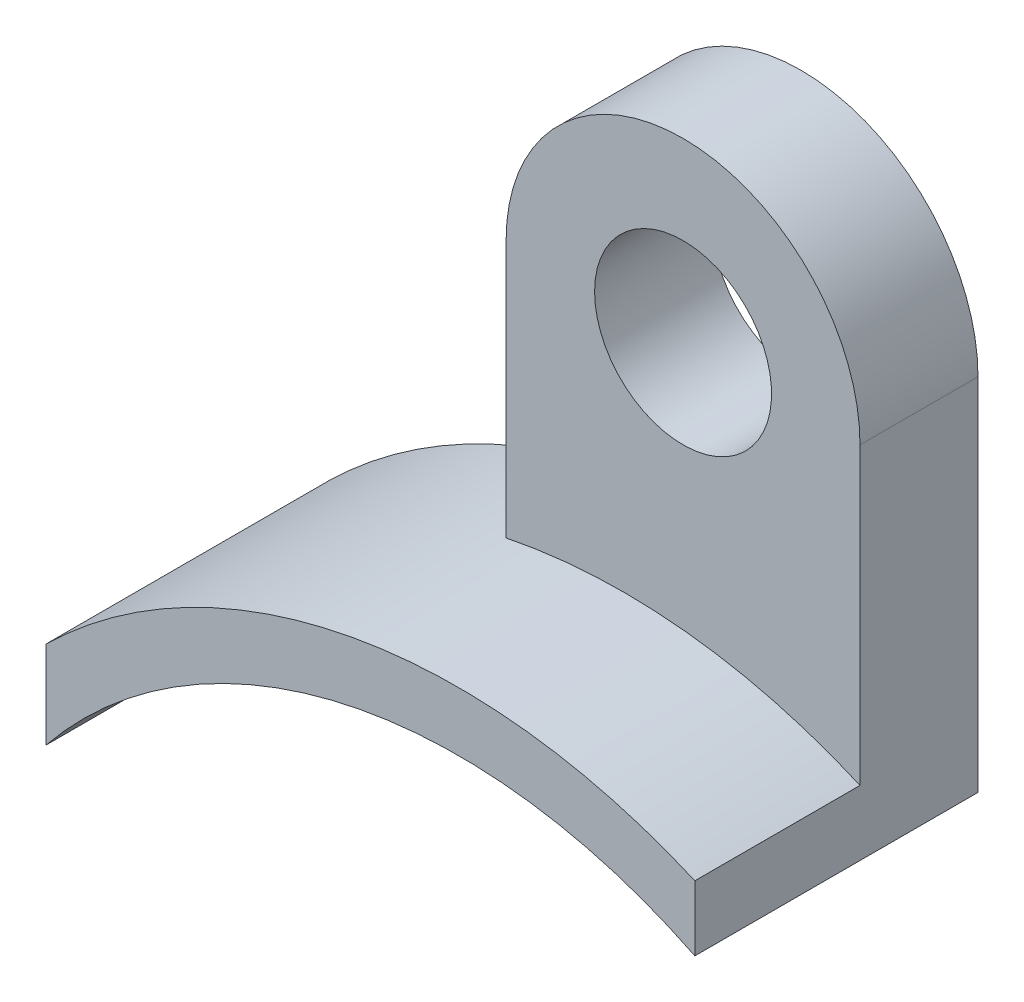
ISO-10303-21;
HEADER;
FILE_DESCRIPTION(('STEP AP214'),'2;1');
FILE_NAME('part.step','',(''),(''),'','','');
FILE_SCHEMA(('AUTOMOTIVE_DESIGN { 1 0 10303 214 1 1 1 1 }'));
ENDSEC;
DATA;
#1=APPLICATION_CONTEXT('core data for automotive mechanical design processes');
#2=APPLICATION_PROTOCOL_DEFINITION('international standard','automotive_design',2000,#1);
#3=PRODUCT_CONTEXT('',#1,'mechanical');
#4=PRODUCT('Part','Part','',(#3));
#5=PRODUCT_RELATED_PRODUCT_CATEGORY('part','',(#4));
#6=PRODUCT_DEFINITION_FORMATION('','',#4);
#7=PRODUCT_DEFINITION_CONTEXT('part definition',#1,'design');
#8=PRODUCT_DEFINITION('design','',#6,#7);
#9=PRODUCT_DEFINITION_SHAPE('','',#8);
#10=(LENGTH_UNIT() NAMED_UNIT(*) SI_UNIT(.MILLI.,.METRE.));
#11=(NAMED_UNIT(*) PLANE_ANGLE_UNIT() SI_UNIT($,.RADIAN.));
#12=(NAMED_UNIT(*) SI_UNIT($,.STERADIAN.) SOLID_ANGLE_UNIT());
#13=UNCERTAINTY_MEASURE_WITH_UNIT(LENGTH_MEASURE(1.E-05),#10,'distance_accuracy_value','');
#14=(GEOMETRIC_REPRESENTATION_CONTEXT(3) GLOBAL_UNCERTAINTY_ASSIGNED_CONTEXT((#13)) GLOBAL_UNIT_ASSIGNED_CONTEXT((#10,
#11,#12)) REPRESENTATION_CONTEXT('',''));
#15=CARTESIAN_POINT('',(0.,0.,0.));
#16=DIRECTION('',(0.,0.,1.));
#17=DIRECTION('',(1.,0.,0.));
#18=AXIS2_PLACEMENT_3D('',#15,#16,#17);
#19=CARTESIAN_POINT('',(0.,0.,24.));
#20=DIRECTION('',(0.,0.,-1.));
#21=DIRECTION('',(-1.,0.,0.));
#22=AXIS2_PLACEMENT_3D('',#19,#20,#21);
#23=CYLINDRICAL_SURFACE('',#22,45.);
#24=CARTESIAN_POINT('',(0.,0.,0.));
#25=DIRECTION('',(0.,0.,-1.));
#26=DIRECTION('',(1.,0.,0.));
#27=AXIS2_PLACEMENT_3D('',#24,#25,#26);
#28=CIRCLE('',#27,45.);
#29=CARTESIAN_POINT('',(-35.,28.2842712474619,0.));
#30=VERTEX_POINT('',#29);
#31=CARTESIAN_POINT('',(20.,40.3112887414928,0.));
#32=VERTEX_POINT('',#31);
#33=EDGE_CURVE('E120',#30,#32,#28,.T.);
#34=ORIENTED_EDGE('',*,*,#33,.T.);
#35=DIRECTION('',(0.,0.,-1.));
#36=VECTOR('',#35,1.);
#37=CARTESIAN_POINT('',(20.,40.3112887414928,24.));
#38=LINE('',#37,#36);
#39=CARTESIAN_POINT('',(20.,40.3112887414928,24.));
#40=VERTEX_POINT('',#39);
#41=EDGE_CURVE('E11',#40,#32,#38,.T.);
#42=ORIENTED_EDGE('',*,*,#41,.F.);
#43=CARTESIAN_POINT('',(0.,0.,24.));
#44=DIRECTION('',(0.,0.,-1.));
#45=DIRECTION('',(1.,0.,0.));
#46=AXIS2_PLACEMENT_3D('',#43,#44,#45);
#47=CIRCLE('',#46,45.);
#48=CARTESIAN_POINT('',(-35.,28.2842712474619,24.));
#49=VERTEX_POINT('',#48);
#50=EDGE_CURVE('E123',#49,#40,#47,.T.);
#51=ORIENTED_EDGE('',*,*,#50,.F.);
#52=DIRECTION('',(0.,0.,-1.));
#53=VECTOR('',#52,1.);
#54=CARTESIAN_POINT('',(-35.,28.2842712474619,24.));
#55=LINE('',#54,#53);
#56=EDGE_CURVE('E133',#49,#30,#55,.T.);
#57=ORIENTED_EDGE('',*,*,#56,.T.);
#58=EDGE_LOOP('',(#34,#42,#51,#57));
#59=FACE_BOUND('',#58,.T.);
#60=ADVANCED_FACE('F31',(#59),#23,.F.);
#61=CARTESIAN_POINT('',(20.,45.8257569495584,24.));
#62=DIRECTION('',(-1.,0.,0.));
#63=DIRECTION('',(0.,-1.,0.));
#64=AXIS2_PLACEMENT_3D('',#61,#62,#63);
#65=PLANE('',#64);
#66=DIRECTION('',(0.,1.,0.));
#67=VECTOR('',#66,1.);
#68=CARTESIAN_POINT('',(20.,45.8257569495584,0.));
#69=LINE('',#68,#67);
#70=CARTESIAN_POINT('',(20.,70.8257569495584,0.));
#71=VERTEX_POINT('',#70);
#72=EDGE_CURVE('E136',#32,#71,#69,.T.);
#73=ORIENTED_EDGE('',*,*,#72,.T.);
#74=DIRECTION('',(0.,0.,-1.));
#75=VECTOR('',#74,1.);
#76=CARTESIAN_POINT('',(20.,70.8257569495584,10.));
#77=LINE('',#76,#75);
#78=CARTESIAN_POINT('',(20.,70.8257569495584,10.));
#79=VERTEX_POINT('',#78);
#80=EDGE_CURVE('E100',#79,#71,#77,.T.);
#81=ORIENTED_EDGE('',*,*,#80,.F.);
#82=DIRECTION('',(0.,-1.,0.));
#83=VECTOR('',#82,1.);
#84=CARTESIAN_POINT('',(20.,45.8257569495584,10.));
#85=LINE('',#84,#83);
#86=CARTESIAN_POINT('',(20.,45.8257569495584,10.));
#87=VERTEX_POINT('',#86);
#88=EDGE_CURVE('E108',#79,#87,#85,.T.);
#89=ORIENTED_EDGE('',*,*,#88,.T.);
#90=DIRECTION('',(0.,0.,-1.));
#91=VECTOR('',#90,1.);
#92=CARTESIAN_POINT('',(20.,45.8257569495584,24.));
#93=LINE('',#92,#91);
#94=CARTESIAN_POINT('',(20.,45.8257569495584,24.));
#95=VERTEX_POINT('',#94);
#96=EDGE_CURVE('E38',#95,#87,#93,.T.);
#97=ORIENTED_EDGE('',*,*,#96,.F.);
#98=DIRECTION('',(0.,1.,0.));
#99=VECTOR('',#98,1.);
#100=CARTESIAN_POINT('',(20.,45.8257569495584,24.));
#101=LINE('',#100,#99);
#102=EDGE_CURVE('E126',#40,#95,#101,.T.);
#103=ORIENTED_EDGE('',*,*,#102,.F.);
#104=ORIENTED_EDGE('',*,*,#41,.T.);
#105=EDGE_LOOP('',(#73,#81,#89,#97,#103,#104));
#106=FACE_BOUND('',#105,.T.);
#107=ADVANCED_FACE('F162',(#106),#65,.F.);
#108=CARTESIAN_POINT('',(0.,0.,24.));
#109=DIRECTION('',(0.,0.,-1.));
#110=DIRECTION('',(-1.,0.,0.));
#111=AXIS2_PLACEMENT_3D('',#108,#109,#110);
#112=CYLINDRICAL_SURFACE('',#111,50.);
#113=CARTESIAN_POINT('',(0.,0.,10.));
#114=DIRECTION('',(0.,0.,1.));
#115=DIRECTION('',(-1.,0.,0.));
#116=AXIS2_PLACEMENT_3D('',#113,#114,#115);
#117=CIRCLE('',#116,50.);
#118=CARTESIAN_POINT('',(-10.,48.9897948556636,10.));
#119=VERTEX_POINT('',#118);
#120=EDGE_CURVE('E45',#87,#119,#117,.T.);
#121=ORIENTED_EDGE('',*,*,#120,.T.);
#122=DIRECTION('',(0.,0.,-1.));
#123=VECTOR('',#122,1.);
#124=CARTESIAN_POINT('',(-10.,48.9897948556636,10.));
#125=LINE('',#124,#123);
#126=CARTESIAN_POINT('',(-10.,48.9897948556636,0.));
#127=VERTEX_POINT('',#126);
#128=EDGE_CURVE('E101',#119,#127,#125,.T.);
#129=ORIENTED_EDGE('',*,*,#128,.T.);
#130=CARTESIAN_POINT('',(0.,0.,0.));
#131=DIRECTION('',(0.,0.,1.));
#132=DIRECTION('',(1.,0.,0.));
#133=AXIS2_PLACEMENT_3D('',#130,#131,#132);
#134=CIRCLE('',#133,50.);
#135=CARTESIAN_POINT('',(-35.,35.7071421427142,0.));
#136=VERTEX_POINT('',#135);
#137=EDGE_CURVE('E138',#127,#136,#134,.T.);
#138=ORIENTED_EDGE('',*,*,#137,.T.);
#139=DIRECTION('',(0.,0.,-1.));
#140=VECTOR('',#139,1.);
#141=CARTESIAN_POINT('',(-35.,35.7071421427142,24.));
#142=LINE('',#141,#140);
#143=CARTESIAN_POINT('',(-35.,35.7071421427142,24.));
#144=VERTEX_POINT('',#143);
#145=EDGE_CURVE('E143',#144,#136,#142,.T.);
#146=ORIENTED_EDGE('',*,*,#145,.F.);
#147=CARTESIAN_POINT('',(0.,0.,24.));
#148=DIRECTION('',(0.,0.,1.));
#149=DIRECTION('',(1.,0.,0.));
#150=AXIS2_PLACEMENT_3D('',#147,#148,#149);
#151=CIRCLE('',#150,50.);
#152=EDGE_CURVE('E129',#95,#144,#151,.T.);
#153=ORIENTED_EDGE('',*,*,#152,.F.);
#154=ORIENTED_EDGE('',*,*,#96,.T.);
#155=EDGE_LOOP('',(#121,#129,#138,#146,#153,#154));
#156=FACE_BOUND('',#155,.T.);
#157=ADVANCED_FACE('F160',(#156),#112,.T.);
#158=CARTESIAN_POINT('',(-35.,35.7071421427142,24.));
#159=DIRECTION('',(1.,0.,0.));
#160=DIRECTION('',(0.,1.,0.));
#161=AXIS2_PLACEMENT_3D('',#158,#159,#160);
#162=PLANE('',#161);
#163=DIRECTION('',(0.,-1.,0.));
#164=VECTOR('',#163,1.);
#165=CARTESIAN_POINT('',(-35.,35.7071421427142,0.));
#166=LINE('',#165,#164);
#167=EDGE_CURVE('E127',#136,#30,#166,.T.);
#168=ORIENTED_EDGE('',*,*,#167,.T.);
#169=ORIENTED_EDGE('',*,*,#56,.F.);
#170=DIRECTION('',(0.,-1.,0.));
#171=VECTOR('',#170,1.);
#172=CARTESIAN_POINT('',(-35.,35.7071421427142,24.));
#173=LINE('',#172,#171);
#174=EDGE_CURVE('E131',#144,#49,#173,.T.);
#175=ORIENTED_EDGE('',*,*,#174,.F.);
#176=ORIENTED_EDGE('',*,*,#145,.T.);
#177=EDGE_LOOP('',(#168,#169,#175,#176));
#178=FACE_BOUND('',#177,.T.);
#179=ADVANCED_FACE('F149',(#178),#162,.F.);
#180=CARTESIAN_POINT('',(0.,0.,24.));
#181=DIRECTION('',(0.,0.,1.));
#182=DIRECTION('',(1.,0.,0.));
#183=AXIS2_PLACEMENT_3D('',#180,#181,#182);
#184=PLANE('',#183);
#185=ORIENTED_EDGE('',*,*,#50,.T.);
#186=ORIENTED_EDGE('',*,*,#102,.T.);
#187=ORIENTED_EDGE('',*,*,#152,.T.);
#188=ORIENTED_EDGE('',*,*,#174,.T.);
#189=EDGE_LOOP('',(#185,#186,#187,#188));
#190=FACE_BOUND('',#189,.T.);
#191=ADVANCED_FACE('F159',(#190),#184,.T.);
#192=CARTESIAN_POINT('',(0.,0.,0.));
#193=DIRECTION('',(0.,0.,1.));
#194=DIRECTION('',(1.,0.,0.));
#195=AXIS2_PLACEMENT_3D('',#192,#193,#194);
#196=PLANE('',#195);
#197=ORIENTED_EDGE('',*,*,#33,.F.);
#198=ORIENTED_EDGE('',*,*,#167,.F.);
#199=ORIENTED_EDGE('',*,*,#137,.F.);
#200=DIRECTION('',(0.,1.,0.));
#201=VECTOR('',#200,1.);
#202=CARTESIAN_POINT('',(-9.99999999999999,70.8257569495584,0.));
#203=LINE('',#202,#201);
#204=CARTESIAN_POINT('',(-9.99999999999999,70.8257569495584,0.));
#205=VERTEX_POINT('',#204);
#206=EDGE_CURVE('E116',#127,#205,#203,.T.);
#207=ORIENTED_EDGE('',*,*,#206,.T.);
#208=CARTESIAN_POINT('',(5.,70.8257569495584,0.));
#209=DIRECTION('',(0.,0.,-1.));
#210=DIRECTION('',(1.,0.,0.));
#211=AXIS2_PLACEMENT_3D('',#208,#209,#210);
#212=CIRCLE('',#211,15.);
#213=EDGE_CURVE('E95',#205,#71,#212,.T.);
#214=ORIENTED_EDGE('',*,*,#213,.T.);
#215=ORIENTED_EDGE('',*,*,#72,.F.);
#216=EDGE_LOOP('',(#197,#198,#199,#207,#214,#215));
#217=FACE_BOUND('',#216,.T.);
#218=CARTESIAN_POINT('',(5.,70.8257569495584,0.));
#219=DIRECTION('',(0.,0.,-1.));
#220=DIRECTION('',(-1.,0.,0.));
#221=AXIS2_PLACEMENT_3D('',#218,#219,#220);
#222=CIRCLE('',#221,7.5);
#223=CARTESIAN_POINT('',(-2.5,70.8257569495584,0.));
#224=VERTEX_POINT('',#223);
#225=EDGE_CURVE('E251',#224,#224,#222,.T.);
#226=ORIENTED_EDGE('',*,*,#225,.F.);
#227=EDGE_LOOP('',(#226));
#228=FACE_BOUND('',#227,.T.);
#229=ADVANCED_FACE('F153',(#217,#228),#196,.F.);
#230=CARTESIAN_POINT('',(5.,70.8257569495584,10.));
#231=DIRECTION('',(0.,0.,-1.));
#232=DIRECTION('',(-1.,0.,0.));
#233=AXIS2_PLACEMENT_3D('',#230,#231,#232);
#234=CYLINDRICAL_SURFACE('',#233,15.);
#235=ORIENTED_EDGE('',*,*,#213,.F.);
#236=DIRECTION('',(0.,0.,-1.));
#237=VECTOR('',#236,1.);
#238=CARTESIAN_POINT('',(-9.99999999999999,70.8257569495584,10.));
#239=LINE('',#238,#237);
#240=CARTESIAN_POINT('',(-9.99999999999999,70.8257569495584,10.));
#241=VERTEX_POINT('',#240);
#242=EDGE_CURVE('E88',#241,#205,#239,.T.);
#243=ORIENTED_EDGE('',*,*,#242,.F.);
#244=CARTESIAN_POINT('',(5.,70.8257569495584,10.));
#245=DIRECTION('',(0.,0.,-1.));
#246=DIRECTION('',(1.,0.,0.));
#247=AXIS2_PLACEMENT_3D('',#244,#245,#246);
#248=CIRCLE('',#247,15.);
#249=EDGE_CURVE('E92',#241,#79,#248,.T.);
#250=ORIENTED_EDGE('',*,*,#249,.T.);
#251=ORIENTED_EDGE('',*,*,#80,.T.);
#252=EDGE_LOOP('',(#235,#243,#250,#251));
#253=FACE_BOUND('',#252,.T.);
#254=ADVANCED_FACE('F90',(#253),#234,.T.);
#255=CARTESIAN_POINT('',(-9.99999999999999,70.8257569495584,10.));
#256=DIRECTION('',(-1.,0.,0.));
#257=DIRECTION('',(0.,-1.,0.));
#258=AXIS2_PLACEMENT_3D('',#255,#256,#257);
#259=PLANE('',#258);
#260=ORIENTED_EDGE('',*,*,#206,.F.);
#261=ORIENTED_EDGE('',*,*,#128,.F.);
#262=DIRECTION('',(0.,1.,0.));
#263=VECTOR('',#262,1.);
#264=CARTESIAN_POINT('',(-9.99999999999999,70.8257569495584,10.));
#265=LINE('',#264,#263);
#266=EDGE_CURVE('E106',#119,#241,#265,.T.);
#267=ORIENTED_EDGE('',*,*,#266,.T.);
#268=ORIENTED_EDGE('',*,*,#242,.T.);
#269=EDGE_LOOP('',(#260,#261,#267,#268));
#270=FACE_BOUND('',#269,.T.);
#271=ADVANCED_FACE('F110',(#270),#259,.T.);
#272=CARTESIAN_POINT('',(0.,0.,10.));
#273=DIRECTION('',(0.,0.,-1.));
#274=DIRECTION('',(-1.,0.,0.));
#275=AXIS2_PLACEMENT_3D('',#272,#273,#274);
#276=PLANE('',#275);
#277=CARTESIAN_POINT('',(5.,70.8257569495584,10.));
#278=DIRECTION('',(0.,0.,-1.));
#279=DIRECTION('',(-1.,0.,0.));
#280=AXIS2_PLACEMENT_3D('',#277,#278,#279);
#281=CIRCLE('',#280,7.5);
#282=CARTESIAN_POINT('',(-2.5,70.8257569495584,10.));
#283=VERTEX_POINT('',#282);
#284=EDGE_CURVE('E118',#283,#283,#281,.T.);
#285=ORIENTED_EDGE('',*,*,#284,.T.);
#286=EDGE_LOOP('',(#285));
#287=FACE_BOUND('',#286,.T.);
#288=ORIENTED_EDGE('',*,*,#120,.F.);
#289=ORIENTED_EDGE('',*,*,#88,.F.);
#290=ORIENTED_EDGE('',*,*,#249,.F.);
#291=ORIENTED_EDGE('',*,*,#266,.F.);
#292=EDGE_LOOP('',(#288,#289,#290,#291));
#293=FACE_BOUND('',#292,.T.);
#294=ADVANCED_FACE('F105',(#287,#293),#276,.F.);
#295=CARTESIAN_POINT('',(5.,70.8257569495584,10.));
#296=DIRECTION('',(0.,0.,-1.));
#297=DIRECTION('',(-1.,0.,0.));
#298=AXIS2_PLACEMENT_3D('',#295,#296,#297);
#299=CYLINDRICAL_SURFACE('',#298,7.5);
#300=ORIENTED_EDGE('',*,*,#284,.F.);
#301=EDGE_LOOP('',(#300));
#302=FACE_BOUND('',#301,.T.);
#303=ORIENTED_EDGE('',*,*,#225,.T.);
#304=EDGE_LOOP('',(#303));
#305=FACE_BOUND('',#304,.T.);
#306=ADVANCED_FACE('F222',(#302,#305),#299,.F.);
#307=CLOSED_SHELL('',(#60,#107,#157,#179,#191,#229,#254,#271,#294,#306));
#308=MANIFOLD_SOLID_BREP('B2',#307);
#309=ADVANCED_BREP_SHAPE_REPRESENTATION('',(#18,#308),#14);
#310=SHAPE_DEFINITION_REPRESENTATION(#9,#309);
ENDSEC;
END-ISO-10303-21;
